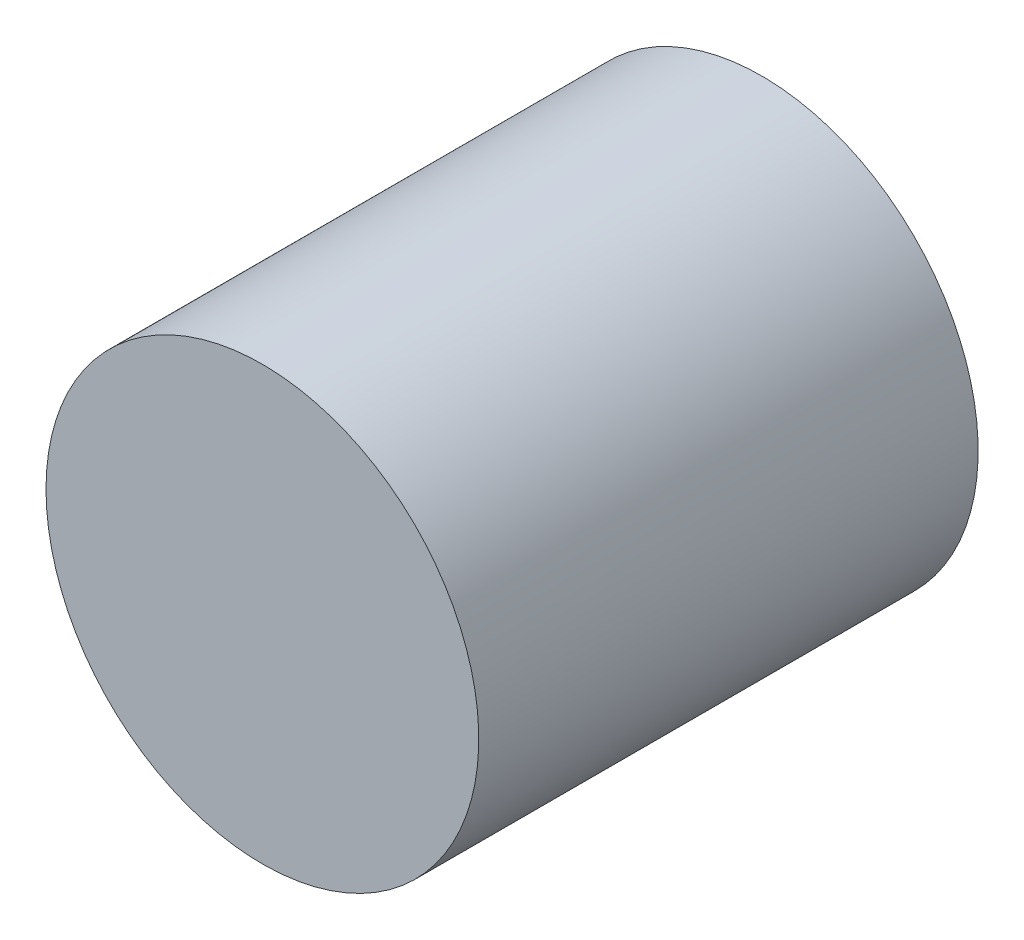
ISO-10303-21;
HEADER;
FILE_DESCRIPTION(('STEP AP214'),'2;1');
FILE_NAME('part.step','',(''),(''),'','','');
FILE_SCHEMA(('AUTOMOTIVE_DESIGN { 1 0 10303 214 1 1 1 1 }'));
ENDSEC;
DATA;
#1=APPLICATION_CONTEXT('core data for automotive mechanical design processes');
#2=APPLICATION_PROTOCOL_DEFINITION('international standard','automotive_design',2000,#1);
#3=PRODUCT_CONTEXT('',#1,'mechanical');
#4=PRODUCT('Part','Part','',(#3));
#5=PRODUCT_RELATED_PRODUCT_CATEGORY('part','',(#4));
#6=PRODUCT_DEFINITION_FORMATION('','',#4);
#7=PRODUCT_DEFINITION_CONTEXT('part definition',#1,'design');
#8=PRODUCT_DEFINITION('design','',#6,#7);
#9=PRODUCT_DEFINITION_SHAPE('','',#8);
#10=(LENGTH_UNIT() NAMED_UNIT(*) SI_UNIT(.MILLI.,.METRE.));
#11=(NAMED_UNIT(*) PLANE_ANGLE_UNIT() SI_UNIT($,.RADIAN.));
#12=(NAMED_UNIT(*) SI_UNIT($,.STERADIAN.) SOLID_ANGLE_UNIT());
#13=UNCERTAINTY_MEASURE_WITH_UNIT(LENGTH_MEASURE(1.E-05),#10,'distance_accuracy_value','');
#14=(GEOMETRIC_REPRESENTATION_CONTEXT(3) GLOBAL_UNCERTAINTY_ASSIGNED_CONTEXT((#13)) GLOBAL_UNIT_ASSIGNED_CONTEXT((#10,
#11,#12)) REPRESENTATION_CONTEXT('',''));
#15=CARTESIAN_POINT('',(0.,0.,0.));
#16=DIRECTION('',(0.,0.,1.));
#17=DIRECTION('',(1.,0.,0.));
#18=AXIS2_PLACEMENT_3D('',#15,#16,#17);
#19=CARTESIAN_POINT('',(-65.806783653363,119.022648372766,38.1));
#20=DIRECTION('',(0.,0.,1.));
#21=DIRECTION('',(1.00000000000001,0.,0.));
#22=AXIS2_PLACEMENT_3D('',#19,#20,#21);
#23=PLANE('',#22);
#24=CARTESIAN_POINT('',(-65.806783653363,119.022648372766,38.1));
#25=DIRECTION('',(0.,0.,-1.));
#26=DIRECTION('',(-1.00000000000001,0.,0.));
#27=AXIS2_PLACEMENT_3D('',#24,#25,#26);
#28=CIRCLE('',#27,16.51);
#29=CARTESIAN_POINT('',(-82.3167836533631,119.022648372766,38.1));
#30=VERTEX_POINT('',#29);
#31=EDGE_CURVE('E25',#30,#30,#28,.T.);
#32=ORIENTED_EDGE('',*,*,#31,.F.);
#33=EDGE_LOOP('',(#32));
#34=FACE_BOUND('',#33,.T.);
#35=ADVANCED_FACE('F22',(#34),#23,.T.);
#36=CARTESIAN_POINT('',(-65.8067836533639,119.022648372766,0.));
#37=DIRECTION('',(0.,0.,1.));
#38=DIRECTION('',(1.00000000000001,0.,0.));
#39=AXIS2_PLACEMENT_3D('',#36,#37,#38);
#40=PLANE('',#39);
#41=CARTESIAN_POINT('',(-65.8067836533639,119.022648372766,0.));
#42=DIRECTION('',(0.,0.,-1.));
#43=DIRECTION('',(-1.00000000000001,0.,0.));
#44=AXIS2_PLACEMENT_3D('',#41,#42,#43);
#45=CIRCLE('',#44,16.51);
#46=CARTESIAN_POINT('',(-82.316783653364,119.022648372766,0.));
#47=VERTEX_POINT('',#46);
#48=EDGE_CURVE('E12',#47,#47,#45,.F.);
#49=ORIENTED_EDGE('',*,*,#48,.F.);
#50=EDGE_LOOP('',(#49));
#51=FACE_BOUND('',#50,.T.);
#52=ADVANCED_FACE('F37',(#51),#40,.F.);
#53=CARTESIAN_POINT('',(-65.806783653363,119.022648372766,38.1));
#54=DIRECTION('',(0.,0.,-1.));
#55=DIRECTION('',(-1.00000000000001,0.,0.));
#56=AXIS2_PLACEMENT_3D('',#53,#54,#55);
#57=CYLINDRICAL_SURFACE('',#56,16.51);
#58=ORIENTED_EDGE('',*,*,#48,.T.);
#59=EDGE_LOOP('',(#58));
#60=FACE_BOUND('',#59,.T.);
#61=ORIENTED_EDGE('',*,*,#31,.T.);
#62=EDGE_LOOP('',(#61));
#63=FACE_BOUND('',#62,.T.);
#64=ADVANCED_FACE('F34',(#60,#63),#57,.T.);
#65=CLOSED_SHELL('',(#35,#52,#64));
#66=MANIFOLD_SOLID_BREP('B1',#65);
#67=ADVANCED_BREP_SHAPE_REPRESENTATION('',(#18,#66),#14);
#68=SHAPE_DEFINITION_REPRESENTATION(#9,#67);
ENDSEC;
END-ISO-10303-21;
